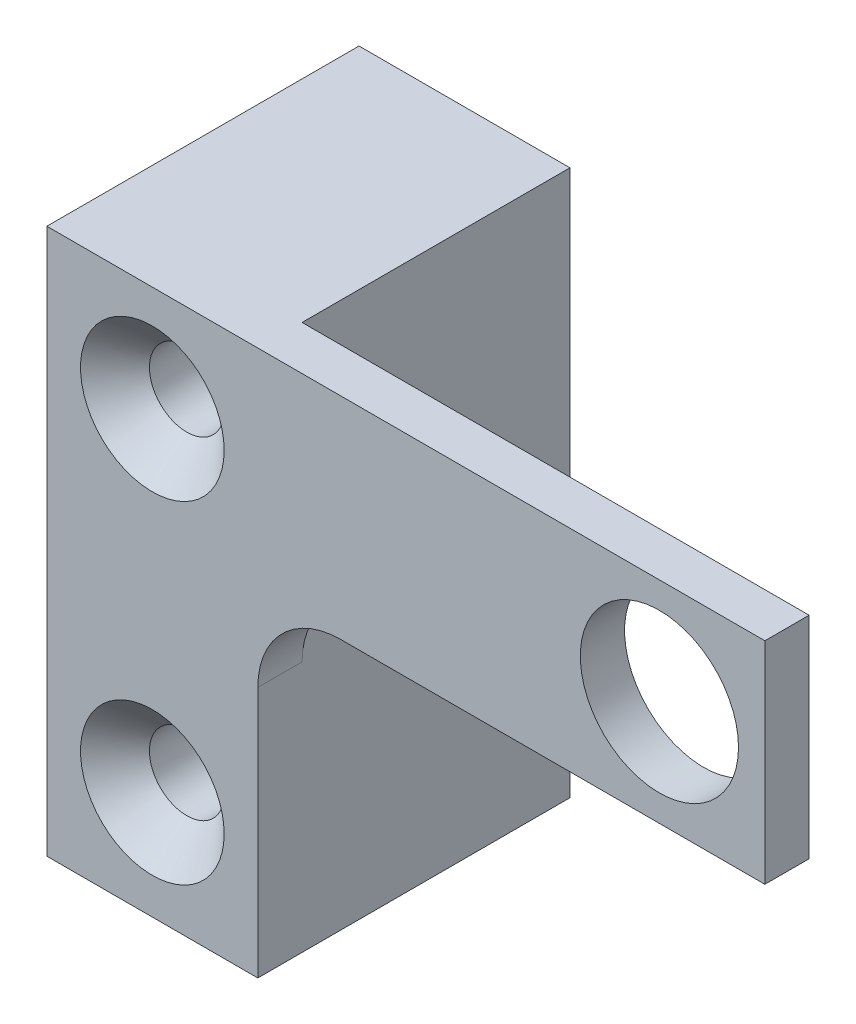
ISO-10303-21;
HEADER;
FILE_DESCRIPTION(('STEP AP214'),'2;1');
FILE_NAME('part.step','',(''),(''),'','','');
FILE_SCHEMA(('AUTOMOTIVE_DESIGN { 1 0 10303 214 1 1 1 1 }'));
ENDSEC;
DATA;
#1=APPLICATION_CONTEXT('core data for automotive mechanical design processes');
#2=APPLICATION_PROTOCOL_DEFINITION('international standard','automotive_design',2000,#1);
#3=PRODUCT_CONTEXT('',#1,'mechanical');
#4=PRODUCT('Part','Part','',(#3));
#5=PRODUCT_RELATED_PRODUCT_CATEGORY('part','',(#4));
#6=PRODUCT_DEFINITION_FORMATION('','',#4);
#7=PRODUCT_DEFINITION_CONTEXT('part definition',#1,'design');
#8=PRODUCT_DEFINITION('design','',#6,#7);
#9=PRODUCT_DEFINITION_SHAPE('','',#8);
#10=(LENGTH_UNIT() NAMED_UNIT(*) SI_UNIT(.MILLI.,.METRE.));
#11=(NAMED_UNIT(*) PLANE_ANGLE_UNIT() SI_UNIT($,.RADIAN.));
#12=(NAMED_UNIT(*) SI_UNIT($,.STERADIAN.) SOLID_ANGLE_UNIT());
#13=UNCERTAINTY_MEASURE_WITH_UNIT(LENGTH_MEASURE(1.E-05),#10,'distance_accuracy_value','');
#14=(GEOMETRIC_REPRESENTATION_CONTEXT(3) GLOBAL_UNCERTAINTY_ASSIGNED_CONTEXT((#13)) GLOBAL_UNIT_ASSIGNED_CONTEXT((#10,
#11,#12)) REPRESENTATION_CONTEXT('',''));
#15=CARTESIAN_POINT('',(0.,0.,0.));
#16=DIRECTION('',(0.,0.,1.));
#17=DIRECTION('',(1.,0.,0.));
#18=AXIS2_PLACEMENT_3D('',#15,#16,#17);
#19=CARTESIAN_POINT('',(0.,-25.4,37.59));
#20=DIRECTION('',(0.,1.,0.));
#21=DIRECTION('',(0.,0.,1.));
#22=AXIS2_PLACEMENT_3D('',#19,#20,#21);
#23=PLANE('',#22);
#24=DIRECTION('',(1.,0.,0.));
#25=VECTOR('',#24,1.);
#26=CARTESIAN_POINT('',(0.,-25.4,37.59));
#27=LINE('',#26,#25);
#28=CARTESIAN_POINT('',(35.4,-25.4,37.59));
#29=VERTEX_POINT('',#28);
#30=CARTESIAN_POINT('',(86.46,-25.4,37.59));
#31=VERTEX_POINT('',#30);
#32=EDGE_CURVE('E118',#29,#31,#27,.T.);
#33=ORIENTED_EDGE('',*,*,#32,.F.);
#34=DIRECTION('',(0.,0.,-1.));
#35=VECTOR('',#34,1.);
#36=CARTESIAN_POINT('',(35.4,-25.4,32.26));
#37=LINE('',#36,#35);
#38=CARTESIAN_POINT('',(35.4,-25.4,32.26));
#39=VERTEX_POINT('',#38);
#40=EDGE_CURVE('E108',#29,#39,#37,.T.);
#41=ORIENTED_EDGE('',*,*,#40,.T.);
#42=DIRECTION('',(1.,0.,0.));
#43=VECTOR('',#42,1.);
#44=CARTESIAN_POINT('',(0.,-25.4,32.26));
#45=LINE('',#44,#43);
#46=CARTESIAN_POINT('',(86.46,-25.4,32.26));
#47=VERTEX_POINT('',#46);
#48=EDGE_CURVE('E126',#39,#47,#45,.T.);
#49=ORIENTED_EDGE('',*,*,#48,.T.);
#50=DIRECTION('',(0.,0.,-1.));
#51=VECTOR('',#50,1.);
#52=CARTESIAN_POINT('',(86.46,-25.4,37.59));
#53=LINE('',#52,#51);
#54=EDGE_CURVE('E146',#31,#47,#53,.T.);
#55=ORIENTED_EDGE('',*,*,#54,.F.);
#56=EDGE_LOOP('',(#33,#41,#49,#55));
#57=FACE_BOUND('',#56,.T.);
#58=ADVANCED_FACE('F34',(#57),#23,.F.);
#59=CARTESIAN_POINT('',(0.,0.,32.26));
#60=DIRECTION('',(1.,0.,0.));
#61=DIRECTION('',(0.,1.,0.));
#62=AXIS2_PLACEMENT_3D('',#59,#60,#61);
#63=PLANE('',#62);
#64=DIRECTION('',(0.,0.,-1.));
#65=VECTOR('',#64,1.);
#66=CARTESIAN_POINT('',(0.,-65.7,32.26));
#67=LINE('',#66,#65);
#68=CARTESIAN_POINT('',(0.,-65.7,37.59));
#69=VERTEX_POINT('',#68);
#70=CARTESIAN_POINT('',(0.,-65.7,0.));
#71=VERTEX_POINT('',#70);
#72=EDGE_CURVE('E99',#69,#71,#67,.T.);
#73=ORIENTED_EDGE('',*,*,#72,.F.);
#74=DIRECTION('',(0.,-1.,0.));
#75=VECTOR('',#74,1.);
#76=CARTESIAN_POINT('',(0.,0.,37.59));
#77=LINE('',#76,#75);
#78=CARTESIAN_POINT('',(0.,0.,37.59));
#79=VERTEX_POINT('',#78);
#80=EDGE_CURVE('E103',#79,#69,#77,.T.);
#81=ORIENTED_EDGE('',*,*,#80,.F.);
#82=DIRECTION('',(0.,0.,-1.));
#83=VECTOR('',#82,1.);
#84=CARTESIAN_POINT('',(0.,0.,32.26));
#85=LINE('',#84,#83);
#86=CARTESIAN_POINT('',(0.,0.,0.));
#87=VERTEX_POINT('',#86);
#88=EDGE_CURVE('E152',#79,#87,#85,.T.);
#89=ORIENTED_EDGE('',*,*,#88,.T.);
#90=DIRECTION('',(0.,-1.,0.));
#91=VECTOR('',#90,1.);
#92=CARTESIAN_POINT('',(0.,0.,0.));
#93=LINE('',#92,#91);
#94=EDGE_CURVE('E105',#87,#71,#93,.T.);
#95=ORIENTED_EDGE('',*,*,#94,.T.);
#96=EDGE_LOOP('',(#73,#81,#89,#95));
#97=FACE_BOUND('',#96,.T.);
#98=ADVANCED_FACE('F101',(#97),#63,.F.);
#99=CARTESIAN_POINT('',(0.,-65.7,32.26));
#100=DIRECTION('',(0.,1.,0.));
#101=DIRECTION('',(0.,0.,1.));
#102=AXIS2_PLACEMENT_3D('',#99,#100,#101);
#103=PLANE('',#102);
#104=DIRECTION('',(1.,0.,0.));
#105=VECTOR('',#104,1.);
#106=CARTESIAN_POINT('',(0.,-65.7,0.));
#107=LINE('',#106,#105);
#108=CARTESIAN_POINT('',(25.4,-65.7,0.));
#109=VERTEX_POINT('',#108);
#110=EDGE_CURVE('E199',#71,#109,#107,.T.);
#111=ORIENTED_EDGE('',*,*,#110,.T.);
#112=DIRECTION('',(0.,0.,-1.));
#113=VECTOR('',#112,1.);
#114=CARTESIAN_POINT('',(25.4,-65.7,32.26));
#115=LINE('',#114,#113);
#116=CARTESIAN_POINT('',(25.4,-65.7,37.59));
#117=VERTEX_POINT('',#116);
#118=EDGE_CURVE('E109',#117,#109,#115,.T.);
#119=ORIENTED_EDGE('',*,*,#118,.F.);
#120=DIRECTION('',(1.,0.,0.));
#121=VECTOR('',#120,1.);
#122=CARTESIAN_POINT('',(0.,-65.7,37.59));
#123=LINE('',#122,#121);
#124=EDGE_CURVE('E115',#69,#117,#123,.T.);
#125=ORIENTED_EDGE('',*,*,#124,.F.);
#126=ORIENTED_EDGE('',*,*,#72,.T.);
#127=EDGE_LOOP('',(#111,#119,#125,#126));
#128=FACE_BOUND('',#127,.T.);
#129=ADVANCED_FACE('F121',(#128),#103,.F.);
#130=CARTESIAN_POINT('',(25.4,0.,32.26));
#131=DIRECTION('',(-1.,0.,0.));
#132=DIRECTION('',(0.,-1.,0.));
#133=AXIS2_PLACEMENT_3D('',#130,#131,#132);
#134=PLANE('',#133);
#135=DIRECTION('',(0.,1.,0.));
#136=VECTOR('',#135,1.);
#137=CARTESIAN_POINT('',(25.4,0.,32.26));
#138=LINE('',#137,#136);
#139=CARTESIAN_POINT('',(25.4,-35.4,32.26));
#140=VERTEX_POINT('',#139);
#141=CARTESIAN_POINT('',(25.4,0.,32.26));
#142=VERTEX_POINT('',#141);
#143=EDGE_CURVE('E49',#140,#142,#138,.T.);
#144=ORIENTED_EDGE('',*,*,#143,.F.);
#145=DIRECTION('',(0.,0.,-1.));
#146=VECTOR('',#145,1.);
#147=CARTESIAN_POINT('',(25.4,-35.4,37.59));
#148=LINE('',#147,#146);
#149=CARTESIAN_POINT('',(25.4,-35.4,37.59));
#150=VERTEX_POINT('',#149);
#151=EDGE_CURVE('E54',#140,#150,#148,.F.);
#152=ORIENTED_EDGE('',*,*,#151,.T.);
#153=DIRECTION('',(0.,1.,0.));
#154=VECTOR('',#153,1.);
#155=CARTESIAN_POINT('',(25.4,-25.4,37.59));
#156=LINE('',#155,#154);
#157=EDGE_CURVE('E123',#117,#150,#156,.T.);
#158=ORIENTED_EDGE('',*,*,#157,.F.);
#159=ORIENTED_EDGE('',*,*,#118,.T.);
#160=DIRECTION('',(0.,1.,0.));
#161=VECTOR('',#160,1.);
#162=CARTESIAN_POINT('',(25.4,0.,0.));
#163=LINE('',#162,#161);
#164=CARTESIAN_POINT('',(25.4,0.,0.));
#165=VERTEX_POINT('',#164);
#166=EDGE_CURVE('E196',#109,#165,#163,.T.);
#167=ORIENTED_EDGE('',*,*,#166,.T.);
#168=DIRECTION('',(0.,0.,-1.));
#169=VECTOR('',#168,1.);
#170=CARTESIAN_POINT('',(25.4,0.,32.26));
#171=LINE('',#170,#169);
#172=EDGE_CURVE('E155',#142,#165,#171,.T.);
#173=ORIENTED_EDGE('',*,*,#172,.F.);
#174=EDGE_LOOP('',(#144,#152,#158,#159,#167,#173));
#175=FACE_BOUND('',#174,.T.);
#176=ADVANCED_FACE('F195',(#175),#134,.F.);
#177=CARTESIAN_POINT('',(0.,0.,32.26));
#178=DIRECTION('',(0.,-1.,0.));
#179=DIRECTION('',(0.,0.,-1.));
#180=AXIS2_PLACEMENT_3D('',#177,#178,#179);
#181=PLANE('',#180);
#182=DIRECTION('',(-1.,0.,0.));
#183=VECTOR('',#182,1.);
#184=CARTESIAN_POINT('',(0.,0.,0.));
#185=LINE('',#184,#183);
#186=EDGE_CURVE('E153',#165,#87,#185,.T.);
#187=ORIENTED_EDGE('',*,*,#186,.T.);
#188=ORIENTED_EDGE('',*,*,#88,.F.);
#189=DIRECTION('',(-1.,0.,0.));
#190=VECTOR('',#189,1.);
#191=CARTESIAN_POINT('',(0.,0.,37.59));
#192=LINE('',#191,#190);
#193=CARTESIAN_POINT('',(86.46,0.,37.59));
#194=VERTEX_POINT('',#193);
#195=EDGE_CURVE('E117',#194,#79,#192,.T.);
#196=ORIENTED_EDGE('',*,*,#195,.F.);
#197=DIRECTION('',(0.,0.,-1.));
#198=VECTOR('',#197,1.);
#199=CARTESIAN_POINT('',(86.46,0.,37.59));
#200=LINE('',#199,#198);
#201=CARTESIAN_POINT('',(86.46,0.,32.26));
#202=VERTEX_POINT('',#201);
#203=EDGE_CURVE('E136',#194,#202,#200,.T.);
#204=ORIENTED_EDGE('',*,*,#203,.T.);
#205=DIRECTION('',(-1.,0.,0.));
#206=VECTOR('',#205,1.);
#207=CARTESIAN_POINT('',(0.,0.,32.26));
#208=LINE('',#207,#206);
#209=EDGE_CURVE('E119',#202,#142,#208,.T.);
#210=ORIENTED_EDGE('',*,*,#209,.T.);
#211=ORIENTED_EDGE('',*,*,#172,.T.);
#212=EDGE_LOOP('',(#187,#188,#196,#204,#210,#211));
#213=FACE_BOUND('',#212,.T.);
#214=ADVANCED_FACE('F189',(#213),#181,.F.);
#215=CARTESIAN_POINT('',(0.,-65.7,0.));
#216=DIRECTION('',(0.,0.,1.));
#217=DIRECTION('',(1.,0.,0.));
#218=AXIS2_PLACEMENT_3D('',#215,#216,#217);
#219=PLANE('',#218);
#220=CARTESIAN_POINT('',(12.7,-12.7,0.));
#221=DIRECTION('',(0.,0.,1.));
#222=DIRECTION('',(1.,0.,0.));
#223=AXIS2_PLACEMENT_3D('',#220,#221,#222);
#224=CIRCLE('',#223,4.49999999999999);
#225=CARTESIAN_POINT('',(17.2,-12.7,0.));
#226=VERTEX_POINT('',#225);
#227=EDGE_CURVE('E164',#226,#226,#224,.T.);
#228=ORIENTED_EDGE('',*,*,#227,.T.);
#229=EDGE_LOOP('',(#228));
#230=FACE_BOUND('',#229,.T.);
#231=CARTESIAN_POINT('',(12.7,-52.7,0.));
#232=DIRECTION('',(0.,0.,1.));
#233=DIRECTION('',(1.,0.,0.));
#234=AXIS2_PLACEMENT_3D('',#231,#232,#233);
#235=CIRCLE('',#234,4.49999999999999);
#236=CARTESIAN_POINT('',(17.2,-52.7,0.));
#237=VERTEX_POINT('',#236);
#238=EDGE_CURVE('E160',#237,#237,#235,.T.);
#239=ORIENTED_EDGE('',*,*,#238,.T.);
#240=EDGE_LOOP('',(#239));
#241=FACE_BOUND('',#240,.T.);
#242=ORIENTED_EDGE('',*,*,#94,.F.);
#243=ORIENTED_EDGE('',*,*,#186,.F.);
#244=ORIENTED_EDGE('',*,*,#166,.F.);
#245=ORIENTED_EDGE('',*,*,#110,.F.);
#246=EDGE_LOOP('',(#242,#243,#244,#245));
#247=FACE_BOUND('',#246,.T.);
#248=ADVANCED_FACE('F198',(#230,#241,#247),#219,.F.);
#249=CARTESIAN_POINT('',(0.,-25.4,32.26));
#250=DIRECTION('',(0.,0.,1.));
#251=DIRECTION('',(1.,0.,0.));
#252=AXIS2_PLACEMENT_3D('',#249,#250,#251);
#253=PLANE('',#252);
#254=CARTESIAN_POINT('',(73.76,-12.7,32.26));
#255=DIRECTION('',(0.,0.,1.));
#256=DIRECTION('',(1.,0.,0.));
#257=AXIS2_PLACEMENT_3D('',#254,#255,#256);
#258=CIRCLE('',#257,9.52500000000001);
#259=CARTESIAN_POINT('',(83.285,-12.7,32.26));
#260=VERTEX_POINT('',#259);
#261=EDGE_CURVE('E124',#260,#260,#258,.T.);
#262=ORIENTED_EDGE('',*,*,#261,.T.);
#263=EDGE_LOOP('',(#262));
#264=FACE_BOUND('',#263,.T.);
#265=ORIENTED_EDGE('',*,*,#48,.F.);
#266=CARTESIAN_POINT('',(35.4,-35.4,32.26));
#267=DIRECTION('',(0.,0.,1.));
#268=DIRECTION('',(1.,0.,0.));
#269=AXIS2_PLACEMENT_3D('',#266,#267,#268);
#270=CIRCLE('',#269,10.);
#271=EDGE_CURVE('E42',#39,#140,#270,.T.);
#272=ORIENTED_EDGE('',*,*,#271,.T.);
#273=ORIENTED_EDGE('',*,*,#143,.T.);
#274=ORIENTED_EDGE('',*,*,#209,.F.);
#275=DIRECTION('',(0.,1.,0.));
#276=VECTOR('',#275,1.);
#277=CARTESIAN_POINT('',(86.46,0.,32.26));
#278=LINE('',#277,#276);
#279=EDGE_CURVE('E138',#47,#202,#278,.T.);
#280=ORIENTED_EDGE('',*,*,#279,.F.);
#281=EDGE_LOOP('',(#265,#272,#273,#274,#280));
#282=FACE_BOUND('',#281,.T.);
#283=ADVANCED_FACE('F173',(#264,#282),#253,.F.);
#284=CARTESIAN_POINT('',(86.46,0.,37.59));
#285=DIRECTION('',(-1.,0.,0.));
#286=DIRECTION('',(0.,0.,1.));
#287=AXIS2_PLACEMENT_3D('',#284,#285,#286);
#288=PLANE('',#287);
#289=ORIENTED_EDGE('',*,*,#279,.T.);
#290=ORIENTED_EDGE('',*,*,#203,.F.);
#291=DIRECTION('',(0.,1.,0.));
#292=VECTOR('',#291,1.);
#293=CARTESIAN_POINT('',(86.46,0.,37.59));
#294=LINE('',#293,#292);
#295=EDGE_CURVE('E133',#31,#194,#294,.T.);
#296=ORIENTED_EDGE('',*,*,#295,.F.);
#297=ORIENTED_EDGE('',*,*,#54,.T.);
#298=EDGE_LOOP('',(#289,#290,#296,#297));
#299=FACE_BOUND('',#298,.T.);
#300=ADVANCED_FACE('F186',(#299),#288,.F.);
#301=CARTESIAN_POINT('',(0.,-25.4,37.59));
#302=DIRECTION('',(0.,0.,1.));
#303=DIRECTION('',(1.,0.,0.));
#304=AXIS2_PLACEMENT_3D('',#301,#302,#303);
#305=PLANE('',#304);
#306=CARTESIAN_POINT('',(12.7,-12.7,37.59));
#307=DIRECTION('',(0.,0.,1.));
#308=DIRECTION('',(1.,0.,0.));
#309=AXIS2_PLACEMENT_3D('',#306,#307,#308);
#310=CIRCLE('',#309,8.65);
#311=CARTESIAN_POINT('',(21.35,-12.7,37.59));
#312=VERTEX_POINT('',#311);
#313=EDGE_CURVE('E249',#312,#312,#310,.T.);
#314=ORIENTED_EDGE('',*,*,#313,.F.);
#315=EDGE_LOOP('',(#314));
#316=FACE_BOUND('',#315,.T.);
#317=CARTESIAN_POINT('',(12.7,-52.7,37.59));
#318=DIRECTION('',(0.,0.,1.));
#319=DIRECTION('',(1.,0.,0.));
#320=AXIS2_PLACEMENT_3D('',#317,#318,#319);
#321=CIRCLE('',#320,8.65);
#322=CARTESIAN_POINT('',(21.35,-52.7,37.59));
#323=VERTEX_POINT('',#322);
#324=EDGE_CURVE('E167',#323,#323,#321,.T.);
#325=ORIENTED_EDGE('',*,*,#324,.F.);
#326=EDGE_LOOP('',(#325));
#327=FACE_BOUND('',#326,.T.);
#328=CARTESIAN_POINT('',(73.76,-12.7,37.59));
#329=DIRECTION('',(0.,0.,1.));
#330=DIRECTION('',(1.,0.,0.));
#331=AXIS2_PLACEMENT_3D('',#328,#329,#330);
#332=CIRCLE('',#331,9.52500000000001);
#333=CARTESIAN_POINT('',(83.285,-12.7,37.59));
#334=VERTEX_POINT('',#333);
#335=EDGE_CURVE('E129',#334,#334,#332,.T.);
#336=ORIENTED_EDGE('',*,*,#335,.F.);
#337=EDGE_LOOP('',(#336));
#338=FACE_BOUND('',#337,.T.);
#339=ORIENTED_EDGE('',*,*,#80,.T.);
#340=ORIENTED_EDGE('',*,*,#124,.T.);
#341=ORIENTED_EDGE('',*,*,#157,.T.);
#342=CARTESIAN_POINT('',(35.4,-35.4,37.59));
#343=DIRECTION('',(0.,0.,1.));
#344=DIRECTION('',(1.,0.,0.));
#345=AXIS2_PLACEMENT_3D('',#342,#343,#344);
#346=CIRCLE('',#345,10.);
#347=EDGE_CURVE('E11',#150,#29,#346,.F.);
#348=ORIENTED_EDGE('',*,*,#347,.T.);
#349=ORIENTED_EDGE('',*,*,#32,.T.);
#350=ORIENTED_EDGE('',*,*,#295,.T.);
#351=ORIENTED_EDGE('',*,*,#195,.T.);
#352=EDGE_LOOP('',(#339,#340,#341,#348,#349,#350,#351));
#353=FACE_BOUND('',#352,.T.);
#354=ADVANCED_FACE('F114',(#316,#327,#338,#353),#305,.T.);
#355=CARTESIAN_POINT('',(73.76,-12.7,-2.50000000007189E-05));
#356=DIRECTION('',(0.,0.,1.));
#357=DIRECTION('',(1.,0.,0.));
#358=AXIS2_PLACEMENT_3D('',#355,#356,#357);
#359=CYLINDRICAL_SURFACE('',#358,9.52500000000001);
#360=ORIENTED_EDGE('',*,*,#335,.T.);
#361=EDGE_LOOP('',(#360));
#362=FACE_BOUND('',#361,.T.);
#363=ORIENTED_EDGE('',*,*,#261,.F.);
#364=EDGE_LOOP('',(#363));
#365=FACE_BOUND('',#364,.T.);
#366=ADVANCED_FACE('F221',(#362,#365),#359,.F.);
#367=CARTESIAN_POINT('',(12.7,-52.7,37.59));
#368=DIRECTION('',(0.,0.,1.));
#369=DIRECTION('',(1.,0.,0.));
#370=AXIS2_PLACEMENT_3D('',#367,#368,#369);
#371=CYLINDRICAL_SURFACE('',#370,4.49999999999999);
#372=CARTESIAN_POINT('',(12.7,-52.7,33.44));
#373=DIRECTION('',(0.,0.,1.));
#374=DIRECTION('',(1.,0.,0.));
#375=AXIS2_PLACEMENT_3D('',#372,#373,#374);
#376=CIRCLE('',#375,4.49999999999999);
#377=CARTESIAN_POINT('',(17.2,-52.7,33.44));
#378=VERTEX_POINT('',#377);
#379=EDGE_CURVE('E163',#378,#378,#376,.T.);
#380=ORIENTED_EDGE('',*,*,#379,.T.);
#381=EDGE_LOOP('',(#380));
#382=FACE_BOUND('',#381,.T.);
#383=ORIENTED_EDGE('',*,*,#238,.F.);
#384=EDGE_LOOP('',(#383));
#385=FACE_BOUND('',#384,.T.);
#386=ADVANCED_FACE('F225',(#382,#385),#371,.F.);
#387=CARTESIAN_POINT('',(12.7,-52.7,37.59));
#388=DIRECTION('',(0.,0.,1.));
#389=DIRECTION('',(1.,0.,0.));
#390=AXIS2_PLACEMENT_3D('',#387,#388,#389);
#391=CONICAL_SURFACE('',#390,8.65,0.785398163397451);
#392=ORIENTED_EDGE('',*,*,#379,.F.);
#393=EDGE_LOOP('',(#392));
#394=FACE_BOUND('',#393,.T.);
#395=ORIENTED_EDGE('',*,*,#324,.T.);
#396=EDGE_LOOP('',(#395));
#397=FACE_BOUND('',#396,.T.);
#398=ADVANCED_FACE('F229',(#394,#397),#391,.F.);
#399=CARTESIAN_POINT('',(12.7,-12.7,37.59));
#400=DIRECTION('',(0.,0.,1.));
#401=DIRECTION('',(1.,0.,0.));
#402=AXIS2_PLACEMENT_3D('',#399,#400,#401);
#403=CYLINDRICAL_SURFACE('',#402,4.49999999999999);
#404=CARTESIAN_POINT('',(12.7,-12.7,33.44));
#405=DIRECTION('',(0.,0.,1.));
#406=DIRECTION('',(1.,0.,0.));
#407=AXIS2_PLACEMENT_3D('',#404,#405,#406);
#408=CIRCLE('',#407,4.49999999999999);
#409=CARTESIAN_POINT('',(17.2,-12.7,33.44));
#410=VERTEX_POINT('',#409);
#411=EDGE_CURVE('E168',#410,#410,#408,.T.);
#412=ORIENTED_EDGE('',*,*,#411,.T.);
#413=EDGE_LOOP('',(#412));
#414=FACE_BOUND('',#413,.T.);
#415=ORIENTED_EDGE('',*,*,#227,.F.);
#416=EDGE_LOOP('',(#415));
#417=FACE_BOUND('',#416,.T.);
#418=ADVANCED_FACE('F233',(#414,#417),#403,.F.);
#419=CARTESIAN_POINT('',(12.7,-12.7,37.59));
#420=DIRECTION('',(0.,0.,1.));
#421=DIRECTION('',(1.,0.,0.));
#422=AXIS2_PLACEMENT_3D('',#419,#420,#421);
#423=CONICAL_SURFACE('',#422,8.65,0.785398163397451);
#424=ORIENTED_EDGE('',*,*,#411,.F.);
#425=EDGE_LOOP('',(#424));
#426=FACE_BOUND('',#425,.T.);
#427=ORIENTED_EDGE('',*,*,#313,.T.);
#428=EDGE_LOOP('',(#427));
#429=FACE_BOUND('',#428,.T.);
#430=ADVANCED_FACE('F237',(#426,#429),#423,.F.);
#431=CARTESIAN_POINT('',(35.4,-35.4,37.59));
#432=DIRECTION('',(0.,0.,1.));
#433=DIRECTION('',(1.,0.,0.));
#434=AXIS2_PLACEMENT_3D('',#431,#432,#433);
#435=CYLINDRICAL_SURFACE('',#434,10.);
#436=ORIENTED_EDGE('',*,*,#347,.F.);
#437=ORIENTED_EDGE('',*,*,#151,.F.);
#438=ORIENTED_EDGE('',*,*,#271,.F.);
#439=ORIENTED_EDGE('',*,*,#40,.F.);
#440=EDGE_LOOP('',(#436,#437,#438,#439));
#441=FACE_BOUND('',#440,.T.);
#442=ADVANCED_FACE('F36',(#441),#435,.F.);
#443=CLOSED_SHELL('',(#58,#98,#129,#176,#214,#248,#283,#300,#354,#366,#386,#398,#418,#430,#442));
#444=MANIFOLD_SOLID_BREP('B2',#443);
#445=ADVANCED_BREP_SHAPE_REPRESENTATION('',(#18,#444),#14);
#446=SHAPE_DEFINITION_REPRESENTATION(#9,#445);
ENDSEC;
END-ISO-10303-21;
